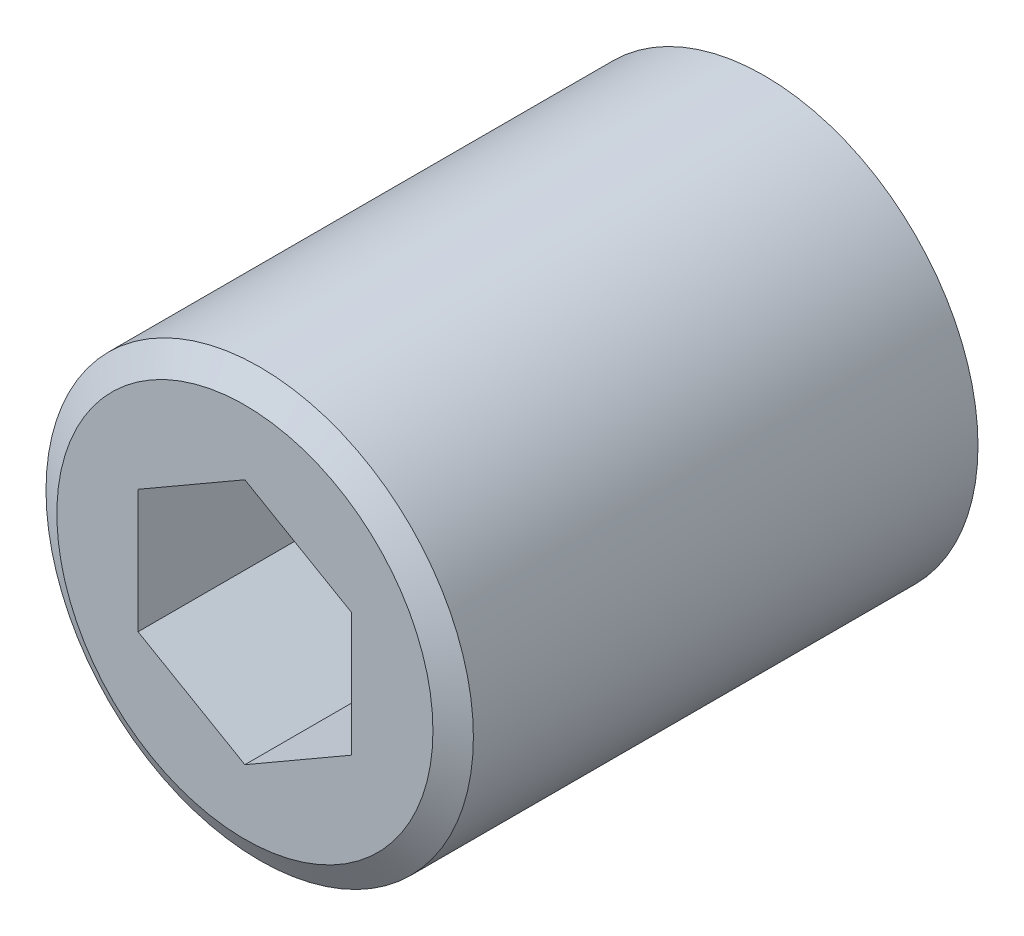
ISO-10303-21;
HEADER;
FILE_DESCRIPTION(('STEP AP214'),'2;1');
FILE_NAME('part.step','',(''),(''),'','','');
FILE_SCHEMA(('AUTOMOTIVE_DESIGN { 1 0 10303 214 1 1 1 1 }'));
ENDSEC;
DATA;
#1=APPLICATION_CONTEXT('core data for automotive mechanical design processes');
#2=APPLICATION_PROTOCOL_DEFINITION('international standard','automotive_design',2000,#1);
#3=PRODUCT_CONTEXT('',#1,'mechanical');
#4=PRODUCT('Part','Part','',(#3));
#5=PRODUCT_RELATED_PRODUCT_CATEGORY('part','',(#4));
#6=PRODUCT_DEFINITION_FORMATION('','',#4);
#7=PRODUCT_DEFINITION_CONTEXT('part definition',#1,'design');
#8=PRODUCT_DEFINITION('design','',#6,#7);
#9=PRODUCT_DEFINITION_SHAPE('','',#8);
#10=(LENGTH_UNIT() NAMED_UNIT(*) SI_UNIT(.MILLI.,.METRE.));
#11=(NAMED_UNIT(*) PLANE_ANGLE_UNIT() SI_UNIT($,.RADIAN.));
#12=(NAMED_UNIT(*) SI_UNIT($,.STERADIAN.) SOLID_ANGLE_UNIT());
#13=UNCERTAINTY_MEASURE_WITH_UNIT(LENGTH_MEASURE(1.E-05),#10,'distance_accuracy_value','');
#14=(GEOMETRIC_REPRESENTATION_CONTEXT(3) GLOBAL_UNCERTAINTY_ASSIGNED_CONTEXT((#13)) GLOBAL_UNIT_ASSIGNED_CONTEXT((#10,
#11,#12)) REPRESENTATION_CONTEXT('',''));
#15=CARTESIAN_POINT('',(0.,0.,0.));
#16=DIRECTION('',(0.,0.,1.));
#17=DIRECTION('',(1.,0.,0.));
#18=AXIS2_PLACEMENT_3D('',#15,#16,#17);
#19=CARTESIAN_POINT('',(10.,0.,1.27));
#20=DIRECTION('',(0.,0.,-1.));
#21=DIRECTION('',(-1.,0.,0.));
#22=AXIS2_PLACEMENT_3D('',#19,#20,#21);
#23=PLANE('',#22);
#24=CARTESIAN_POINT('',(0.,0.,1.27));
#25=DIRECTION('',(0.,0.,-1.));
#26=DIRECTION('',(-1.,0.,0.));
#27=AXIS2_PLACEMENT_3D('',#24,#25,#26);
#28=CIRCLE('',#27,8.8);
#29=CARTESIAN_POINT('',(-8.8,0.,1.27));
#30=VERTEX_POINT('',#29);
#31=EDGE_CURVE('E9',#30,#30,#28,.T.);
#32=ORIENTED_EDGE('',*,*,#31,.T.);
#33=EDGE_LOOP('',(#32));
#34=FACE_BOUND('',#33,.T.);
#35=CARTESIAN_POINT('',(0.,0.,1.27));
#36=DIRECTION('',(0.,0.,-1.));
#37=DIRECTION('',(-1.,0.,0.));
#38=AXIS2_PLACEMENT_3D('',#35,#36,#37);
#39=CIRCLE('',#38,6.35);
#40=CARTESIAN_POINT('',(-6.35,0.,1.27));
#41=VERTEX_POINT('',#40);
#42=EDGE_CURVE('E305',#41,#41,#39,.T.);
#43=ORIENTED_EDGE('',*,*,#42,.F.);
#44=EDGE_LOOP('',(#43));
#45=FACE_BOUND('',#44,.T.);
#46=ADVANCED_FACE('F15',(#34,#45),#23,.T.);
#47=CARTESIAN_POINT('',(0.,0.,46.27));
#48=DIRECTION('',(0.,0.,1.));
#49=DIRECTION('',(1.,0.,0.));
#50=AXIS2_PLACEMENT_3D('',#47,#48,#49);
#51=CYLINDRICAL_SURFACE('',#50,10.);
#52=CARTESIAN_POINT('',(0.,0.,25.5771796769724));
#53=DIRECTION('',(0.,0.,1.));
#54=DIRECTION('',(1.,0.,0.));
#55=AXIS2_PLACEMENT_3D('',#52,#53,#54);
#56=CIRCLE('',#55,10.);
#57=CARTESIAN_POINT('',(10.,0.,25.5771796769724));
#58=VERTEX_POINT('',#57);
#59=EDGE_CURVE('E24',#58,#58,#56,.F.);
#60=ORIENTED_EDGE('',*,*,#59,.T.);
#61=EDGE_LOOP('',(#60));
#62=FACE_BOUND('',#61,.T.);
#63=CARTESIAN_POINT('',(0.,0.,1.96282032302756));
#64=DIRECTION('',(0.,0.,-1.));
#65=DIRECTION('',(-1.,0.,0.));
#66=AXIS2_PLACEMENT_3D('',#63,#64,#65);
#67=CIRCLE('',#66,10.);
#68=CARTESIAN_POINT('',(-10.,0.,1.96282032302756));
#69=VERTEX_POINT('',#68);
#70=EDGE_CURVE('E240',#69,#69,#67,.F.);
#71=ORIENTED_EDGE('',*,*,#70,.T.);
#72=EDGE_LOOP('',(#71));
#73=FACE_BOUND('',#72,.T.);
#74=ADVANCED_FACE('F247',(#62,#73),#51,.T.);
#75=CARTESIAN_POINT('',(0.,0.,26.27));
#76=DIRECTION('',(0.,0.,1.));
#77=DIRECTION('',(1.,0.,0.));
#78=AXIS2_PLACEMENT_3D('',#75,#76,#77);
#79=PLANE('',#78);
#80=CARTESIAN_POINT('',(0.,0.,26.27));
#81=DIRECTION('',(0.,0.,1.));
#82=DIRECTION('',(1.,0.,0.));
#83=AXIS2_PLACEMENT_3D('',#80,#81,#82);
#84=CIRCLE('',#83,8.8);
#85=CARTESIAN_POINT('',(8.8,0.,26.27));
#86=VERTEX_POINT('',#85);
#87=EDGE_CURVE('E236',#86,#86,#84,.T.);
#88=ORIENTED_EDGE('',*,*,#87,.T.);
#89=EDGE_LOOP('',(#88));
#90=FACE_BOUND('',#89,.T.);
#91=DIRECTION('',(0.86602540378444,-0.5,0.));
#92=VECTOR('',#91,1.);
#93=CARTESIAN_POINT('',(-5.,-2.88675134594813,26.27));
#94=LINE('',#93,#92);
#95=CARTESIAN_POINT('',(-5.,-2.88675134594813,26.27));
#96=VERTEX_POINT('',#95);
#97=CARTESIAN_POINT('',(0.,-5.77350269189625,26.27));
#98=VERTEX_POINT('',#97);
#99=EDGE_CURVE('E153',#96,#98,#94,.T.);
#100=ORIENTED_EDGE('',*,*,#99,.F.);
#101=DIRECTION('',(0.,-1.,0.));
#102=VECTOR('',#101,1.);
#103=CARTESIAN_POINT('',(-5.,2.88675134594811,26.27));
#104=LINE('',#103,#102);
#105=CARTESIAN_POINT('',(-5.,2.88675134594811,26.27));
#106=VERTEX_POINT('',#105);
#107=EDGE_CURVE('E173',#106,#96,#104,.T.);
#108=ORIENTED_EDGE('',*,*,#107,.F.);
#109=DIRECTION('',(0.866025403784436,0.5,0.));
#110=VECTOR('',#109,1.);
#111=CARTESIAN_POINT('',(-5.,2.88675134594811,26.27));
#112=LINE('',#111,#110);
#113=CARTESIAN_POINT('',(0.,5.77350269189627,26.27));
#114=VERTEX_POINT('',#113);
#115=EDGE_CURVE('E169',#106,#114,#112,.T.);
#116=ORIENTED_EDGE('',*,*,#115,.T.);
#117=DIRECTION('',(-0.866025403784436,0.5,0.));
#118=VECTOR('',#117,1.);
#119=CARTESIAN_POINT('',(5.,2.88675134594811,26.27));
#120=LINE('',#119,#118);
#121=CARTESIAN_POINT('',(5.,2.88675134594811,26.27));
#122=VERTEX_POINT('',#121);
#123=EDGE_CURVE('E165',#122,#114,#120,.T.);
#124=ORIENTED_EDGE('',*,*,#123,.F.);
#125=DIRECTION('',(0.,-1.,0.));
#126=VECTOR('',#125,1.);
#127=CARTESIAN_POINT('',(5.,2.88675134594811,26.27));
#128=LINE('',#127,#126);
#129=CARTESIAN_POINT('',(5.,-2.88675134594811,26.27));
#130=VERTEX_POINT('',#129);
#131=EDGE_CURVE('E161',#122,#130,#128,.T.);
#132=ORIENTED_EDGE('',*,*,#131,.T.);
#133=DIRECTION('',(-0.866025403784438,-0.5,0.));
#134=VECTOR('',#133,1.);
#135=CARTESIAN_POINT('',(5.,-2.88675134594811,26.27));
#136=LINE('',#135,#134);
#137=EDGE_CURVE('E156',#130,#98,#136,.T.);
#138=ORIENTED_EDGE('',*,*,#137,.T.);
#139=EDGE_LOOP('',(#100,#108,#116,#124,#132,#138));
#140=FACE_BOUND('',#139,.T.);
#141=ADVANCED_FACE('F255',(#90,#140),#79,.T.);
#142=CARTESIAN_POINT('',(-5.,-2.88675134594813,18.27));
#143=DIRECTION('',(-0.5,-0.86602540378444,0.));
#144=DIRECTION('',(-0.86602540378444,0.5,0.));
#145=AXIS2_PLACEMENT_3D('',#142,#143,#144);
#146=PLANE('',#145);
#147=DIRECTION('',(0.,0.,1.));
#148=VECTOR('',#147,1.);
#149=CARTESIAN_POINT('',(-5.,-2.88675134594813,18.27));
#150=LINE('',#149,#148);
#151=CARTESIAN_POINT('',(-5.,-2.88675134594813,18.27));
#152=VERTEX_POINT('',#151);
#153=EDGE_CURVE('E217',#152,#96,#150,.T.);
#154=ORIENTED_EDGE('',*,*,#153,.T.);
#155=ORIENTED_EDGE('',*,*,#99,.T.);
#156=DIRECTION('',(0.,0.,1.));
#157=VECTOR('',#156,1.);
#158=CARTESIAN_POINT('',(0.,-5.77350269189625,18.27));
#159=LINE('',#158,#157);
#160=CARTESIAN_POINT('',(0.,-5.77350269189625,18.27));
#161=VERTEX_POINT('',#160);
#162=EDGE_CURVE('E201',#161,#98,#159,.T.);
#163=ORIENTED_EDGE('',*,*,#162,.F.);
#164=DIRECTION('',(0.86602540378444,-0.5,0.));
#165=VECTOR('',#164,1.);
#166=CARTESIAN_POINT('',(-5.,-2.88675134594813,18.27));
#167=LINE('',#166,#165);
#168=EDGE_CURVE('E177',#152,#161,#167,.T.);
#169=ORIENTED_EDGE('',*,*,#168,.F.);
#170=EDGE_LOOP('',(#154,#155,#163,#169));
#171=FACE_BOUND('',#170,.T.);
#172=ADVANCED_FACE('F258',(#171),#146,.F.);
#173=CARTESIAN_POINT('',(-5.,2.88675134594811,18.27));
#174=DIRECTION('',(-1.,0.,0.));
#175=DIRECTION('',(0.,1.,0.));
#176=AXIS2_PLACEMENT_3D('',#173,#174,#175);
#177=PLANE('',#176);
#178=DIRECTION('',(0.,0.,1.));
#179=VECTOR('',#178,1.);
#180=CARTESIAN_POINT('',(-5.,2.88675134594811,18.27));
#181=LINE('',#180,#179);
#182=CARTESIAN_POINT('',(-5.,2.88675134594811,18.27));
#183=VERTEX_POINT('',#182);
#184=EDGE_CURVE('E214',#183,#106,#181,.T.);
#185=ORIENTED_EDGE('',*,*,#184,.T.);
#186=ORIENTED_EDGE('',*,*,#107,.T.);
#187=ORIENTED_EDGE('',*,*,#153,.F.);
#188=DIRECTION('',(0.,-1.,0.));
#189=VECTOR('',#188,1.);
#190=CARTESIAN_POINT('',(-5.,2.88675134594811,18.27));
#191=LINE('',#190,#189);
#192=EDGE_CURVE('E197',#183,#152,#191,.T.);
#193=ORIENTED_EDGE('',*,*,#192,.F.);
#194=EDGE_LOOP('',(#185,#186,#187,#193));
#195=FACE_BOUND('',#194,.T.);
#196=ADVANCED_FACE('F284',(#195),#177,.F.);
#197=CARTESIAN_POINT('',(-5.,2.88675134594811,18.27));
#198=DIRECTION('',(0.5,-0.866025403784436,0.));
#199=DIRECTION('',(-0.866025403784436,-0.5,0.));
#200=AXIS2_PLACEMENT_3D('',#197,#198,#199);
#201=PLANE('',#200);
#202=DIRECTION('',(0.,0.,1.));
#203=VECTOR('',#202,1.);
#204=CARTESIAN_POINT('',(0.,5.77350269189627,18.27));
#205=LINE('',#204,#203);
#206=CARTESIAN_POINT('',(0.,5.77350269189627,18.27));
#207=VERTEX_POINT('',#206);
#208=EDGE_CURVE('E211',#207,#114,#205,.T.);
#209=ORIENTED_EDGE('',*,*,#208,.T.);
#210=ORIENTED_EDGE('',*,*,#115,.F.);
#211=ORIENTED_EDGE('',*,*,#184,.F.);
#212=DIRECTION('',(0.866025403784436,0.5,0.));
#213=VECTOR('',#212,1.);
#214=CARTESIAN_POINT('',(-5.,2.88675134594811,18.27));
#215=LINE('',#214,#213);
#216=EDGE_CURVE('E193',#183,#207,#215,.T.);
#217=ORIENTED_EDGE('',*,*,#216,.T.);
#218=EDGE_LOOP('',(#209,#210,#211,#217));
#219=FACE_BOUND('',#218,.T.);
#220=ADVANCED_FACE('F281',(#219),#201,.T.);
#221=CARTESIAN_POINT('',(5.,2.88675134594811,18.27));
#222=DIRECTION('',(0.5,0.866025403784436,0.));
#223=DIRECTION('',(0.866025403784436,-0.5,0.));
#224=AXIS2_PLACEMENT_3D('',#221,#222,#223);
#225=PLANE('',#224);
#226=DIRECTION('',(0.,0.,1.));
#227=VECTOR('',#226,1.);
#228=CARTESIAN_POINT('',(5.,2.88675134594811,18.27));
#229=LINE('',#228,#227);
#230=CARTESIAN_POINT('',(5.,2.88675134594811,18.27));
#231=VERTEX_POINT('',#230);
#232=EDGE_CURVE('E208',#231,#122,#229,.T.);
#233=ORIENTED_EDGE('',*,*,#232,.T.);
#234=ORIENTED_EDGE('',*,*,#123,.T.);
#235=ORIENTED_EDGE('',*,*,#208,.F.);
#236=DIRECTION('',(-0.866025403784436,0.5,0.));
#237=VECTOR('',#236,1.);
#238=CARTESIAN_POINT('',(5.,2.88675134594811,18.27));
#239=LINE('',#238,#237);
#240=EDGE_CURVE('E189',#231,#207,#239,.T.);
#241=ORIENTED_EDGE('',*,*,#240,.F.);
#242=EDGE_LOOP('',(#233,#234,#235,#241));
#243=FACE_BOUND('',#242,.T.);
#244=ADVANCED_FACE('F277',(#243),#225,.F.);
#245=CARTESIAN_POINT('',(5.,2.88675134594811,18.27));
#246=DIRECTION('',(-1.,0.,0.));
#247=DIRECTION('',(0.,1.,0.));
#248=AXIS2_PLACEMENT_3D('',#245,#246,#247);
#249=PLANE('',#248);
#250=DIRECTION('',(0.,0.,1.));
#251=VECTOR('',#250,1.);
#252=CARTESIAN_POINT('',(5.,-2.88675134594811,18.27));
#253=LINE('',#252,#251);
#254=CARTESIAN_POINT('',(5.,-2.88675134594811,18.27));
#255=VERTEX_POINT('',#254);
#256=EDGE_CURVE('E205',#255,#130,#253,.T.);
#257=ORIENTED_EDGE('',*,*,#256,.T.);
#258=ORIENTED_EDGE('',*,*,#131,.F.);
#259=ORIENTED_EDGE('',*,*,#232,.F.);
#260=DIRECTION('',(0.,-1.,0.));
#261=VECTOR('',#260,1.);
#262=CARTESIAN_POINT('',(5.,2.88675134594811,18.27));
#263=LINE('',#262,#261);
#264=EDGE_CURVE('E185',#231,#255,#263,.T.);
#265=ORIENTED_EDGE('',*,*,#264,.T.);
#266=EDGE_LOOP('',(#257,#258,#259,#265));
#267=FACE_BOUND('',#266,.T.);
#268=ADVANCED_FACE('F273',(#267),#249,.T.);
#269=CARTESIAN_POINT('',(5.,-2.88675134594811,18.27));
#270=DIRECTION('',(-0.5,0.866025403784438,0.));
#271=DIRECTION('',(0.866025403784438,0.5,0.));
#272=AXIS2_PLACEMENT_3D('',#269,#270,#271);
#273=PLANE('',#272);
#274=DIRECTION('',(-0.866025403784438,-0.5,0.));
#275=VECTOR('',#274,1.);
#276=CARTESIAN_POINT('',(5.,-2.88675134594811,18.27));
#277=LINE('',#276,#275);
#278=EDGE_CURVE('E181',#255,#161,#277,.T.);
#279=ORIENTED_EDGE('',*,*,#278,.T.);
#280=ORIENTED_EDGE('',*,*,#162,.T.);
#281=ORIENTED_EDGE('',*,*,#137,.F.);
#282=ORIENTED_EDGE('',*,*,#256,.F.);
#283=EDGE_LOOP('',(#279,#280,#281,#282));
#284=FACE_BOUND('',#283,.T.);
#285=ADVANCED_FACE('F266',(#284),#273,.T.);
#286=CARTESIAN_POINT('',(5.,-8.66025403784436,18.27));
#287=DIRECTION('',(0.,0.,-1.));
#288=DIRECTION('',(-1.,0.,0.));
#289=AXIS2_PLACEMENT_3D('',#286,#287,#288);
#290=PLANE('',#289);
#291=ORIENTED_EDGE('',*,*,#168,.T.);
#292=ORIENTED_EDGE('',*,*,#278,.F.);
#293=ORIENTED_EDGE('',*,*,#264,.F.);
#294=ORIENTED_EDGE('',*,*,#240,.T.);
#295=ORIENTED_EDGE('',*,*,#216,.F.);
#296=ORIENTED_EDGE('',*,*,#192,.T.);
#297=EDGE_LOOP('',(#291,#292,#293,#294,#295,#296));
#298=FACE_BOUND('',#297,.T.);
#299=ADVANCED_FACE('F270',(#298),#290,.F.);
#300=CARTESIAN_POINT('',(0.,0.,13.97));
#301=DIRECTION('',(0.,0.,-1.));
#302=DIRECTION('',(-1.,0.,0.));
#303=AXIS2_PLACEMENT_3D('',#300,#301,#302);
#304=CYLINDRICAL_SURFACE('',#303,6.35);
#305=ORIENTED_EDGE('',*,*,#42,.T.);
#306=EDGE_LOOP('',(#305));
#307=FACE_BOUND('',#306,.T.);
#308=CARTESIAN_POINT('',(0.,0.,1.5));
#309=DIRECTION('',(0.,0.,1.));
#310=DIRECTION('',(1.,0.,0.));
#311=AXIS2_PLACEMENT_3D('',#308,#309,#310);
#312=CIRCLE('',#311,6.35);
#313=CARTESIAN_POINT('',(6.35,0.,1.5));
#314=VERTEX_POINT('',#313);
#315=EDGE_CURVE('E134',#314,#314,#312,.T.);
#316=ORIENTED_EDGE('',*,*,#315,.T.);
#317=EDGE_LOOP('',(#316));
#318=FACE_BOUND('',#317,.T.);
#319=ADVANCED_FACE('F417',(#307,#318),#304,.F.);
#320=CARTESIAN_POINT('',(6.35,0.,1.5));
#321=DIRECTION('',(0.,-0.707106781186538,0.707106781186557));
#322=DIRECTION('',(0.,0.707106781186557,0.707106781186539));
#323=AXIS2_PLACEMENT_3D('',#320,#321,#322);
#324=PLANE('',#323);
#325=DIRECTION('',(-1.,0.,0.));
#326=VECTOR('',#325,1.);
#327=CARTESIAN_POINT('',(6.35,0.,1.5));
#328=LINE('',#327,#326);
#329=CARTESIAN_POINT('',(0.,0.,1.5));
#330=VERTEX_POINT('',#329);
#331=CARTESIAN_POINT('',(-3.,0.,1.5));
#332=VERTEX_POINT('',#331);
#333=EDGE_CURVE('E313',#330,#332,#328,.T.);
#334=ORIENTED_EDGE('',*,*,#333,.F.);
#335=DIRECTION('',(0.577350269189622,0.577350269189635,0.57735026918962));
#336=VECTOR('',#335,1.);
#337=CARTESIAN_POINT('',(-2.11666666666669,-2.11666666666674,-0.616666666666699));
#338=LINE('',#337,#336);
#339=CARTESIAN_POINT('',(-1.5,-1.5,0.));
#340=VERTEX_POINT('',#339);
#341=EDGE_CURVE('E341',#340,#330,#338,.T.);
#342=ORIENTED_EDGE('',*,*,#341,.F.);
#343=DIRECTION('',(0.577350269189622,-0.577350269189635,-0.57735026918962));
#344=VECTOR('',#343,1.);
#345=CARTESIAN_POINT('',(0.116666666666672,-3.11666666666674,-1.61666666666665));
#346=LINE('',#345,#344);
#347=EDGE_CURVE('E345',#332,#340,#346,.T.);
#348=ORIENTED_EDGE('',*,*,#347,.F.);
#349=EDGE_LOOP('',(#334,#342,#348));
#350=FACE_BOUND('',#349,.T.);
#351=ADVANCED_FACE('F383',(#350),#324,.F.);
#352=CARTESIAN_POINT('',(6.35,1.49999999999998,0.));
#353=DIRECTION('',(0.,0.707106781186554,0.707106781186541));
#354=DIRECTION('',(0.,0.707106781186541,-0.707106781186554));
#355=AXIS2_PLACEMENT_3D('',#352,#353,#354);
#356=PLANE('',#355);
#357=DIRECTION('',(-0.577350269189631,0.577350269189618,-0.577350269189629));
#358=VECTOR('',#357,1.);
#359=CARTESIAN_POINT('',(2.11666666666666,-2.11666666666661,3.61666666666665));
#360=LINE('',#359,#358);
#361=CARTESIAN_POINT('',(-1.49999999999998,1.49999999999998,0.));
#362=VERTEX_POINT('',#361);
#363=EDGE_CURVE('E352',#330,#362,#360,.T.);
#364=ORIENTED_EDGE('',*,*,#363,.F.);
#365=ORIENTED_EDGE('',*,*,#333,.T.);
#366=DIRECTION('',(-0.577350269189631,-0.577350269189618,0.577350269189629));
#367=VECTOR('',#366,1.);
#368=CARTESIAN_POINT('',(-4.11666666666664,-1.11666666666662,2.61666666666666));
#369=LINE('',#368,#367);
#370=EDGE_CURVE('E137',#362,#332,#369,.T.);
#371=ORIENTED_EDGE('',*,*,#370,.F.);
#372=EDGE_LOOP('',(#364,#365,#371));
#373=FACE_BOUND('',#372,.T.);
#374=ADVANCED_FACE('F381',(#373),#356,.F.);
#375=CARTESIAN_POINT('',(0.,-6.35,1.5));
#376=DIRECTION('',(-0.707106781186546,0.,0.707106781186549));
#377=DIRECTION('',(0.707106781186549,0.,0.707106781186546));
#378=AXIS2_PLACEMENT_3D('',#375,#376,#377);
#379=PLANE('',#378);
#380=DIRECTION('',(0.,1.,0.));
#381=VECTOR('',#380,1.);
#382=CARTESIAN_POINT('',(0.,-6.35,1.5));
#383=LINE('',#382,#381);
#384=CARTESIAN_POINT('',(0.,3.00000000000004,1.5));
#385=VERTEX_POINT('',#384);
#386=EDGE_CURVE('E145',#330,#385,#383,.T.);
#387=ORIENTED_EDGE('',*,*,#386,.F.);
#388=ORIENTED_EDGE('',*,*,#363,.T.);
#389=DIRECTION('',(0.577350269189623,0.577350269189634,0.577350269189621));
#390=VECTOR('',#389,1.);
#391=CARTESIAN_POINT('',(-3.1166666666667,-0.116666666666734,-1.6166666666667));
#392=LINE('',#391,#390);
#393=EDGE_CURVE('E115',#362,#385,#392,.T.);
#394=ORIENTED_EDGE('',*,*,#393,.T.);
#395=EDGE_LOOP('',(#387,#388,#394));
#396=FACE_BOUND('',#395,.T.);
#397=ADVANCED_FACE('F377',(#396),#379,.F.);
#398=CARTESIAN_POINT('',(1.5,-6.35,0.));
#399=DIRECTION('',(0.707106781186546,0.,0.707106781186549));
#400=DIRECTION('',(0.707106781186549,0.,-0.707106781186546));
#401=AXIS2_PLACEMENT_3D('',#398,#399,#400);
#402=PLANE('',#401);
#403=DIRECTION('',(0.577350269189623,-0.577350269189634,-0.577350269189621));
#404=VECTOR('',#403,1.);
#405=CARTESIAN_POINT('',(4.11666666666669,-1.11666666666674,-2.6166666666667));
#406=LINE('',#405,#404);
#407=CARTESIAN_POINT('',(1.49999999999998,1.49999999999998,0.));
#408=VERTEX_POINT('',#407);
#409=EDGE_CURVE('E321',#385,#408,#406,.T.);
#410=ORIENTED_EDGE('',*,*,#409,.T.);
#411=DIRECTION('',(-0.577350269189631,-0.577350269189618,0.577350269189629));
#412=VECTOR('',#411,1.);
#413=CARTESIAN_POINT('',(-1.11666666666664,-1.11666666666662,2.61666666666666));
#414=LINE('',#413,#412);
#415=EDGE_CURVE('E348',#408,#330,#414,.T.);
#416=ORIENTED_EDGE('',*,*,#415,.T.);
#417=ORIENTED_EDGE('',*,*,#386,.T.);
#418=EDGE_LOOP('',(#410,#416,#417));
#419=FACE_BOUND('',#418,.T.);
#420=ADVANCED_FACE('F375',(#419),#402,.F.);
#421=DIRECTION('',(-0.577350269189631,0.577350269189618,-0.577350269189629));
#422=VECTOR('',#421,1.);
#423=CARTESIAN_POINT('',(4.11666666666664,-1.11666666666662,2.61666666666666));
#424=LINE('',#423,#422);
#425=CARTESIAN_POINT('',(3.,0.,1.5));
#426=VERTEX_POINT('',#425);
#427=EDGE_CURVE('E224',#426,#408,#424,.T.);
#428=ORIENTED_EDGE('',*,*,#427,.F.);
#429=EDGE_CURVE('E31',#426,#330,#328,.T.);
#430=ORIENTED_EDGE('',*,*,#429,.T.);
#431=ORIENTED_EDGE('',*,*,#415,.F.);
#432=EDGE_LOOP('',(#428,#430,#431));
#433=FACE_BOUND('',#432,.T.);
#434=ADVANCED_FACE('F405',(#433),#356,.F.);
#435=ORIENTED_EDGE('',*,*,#429,.F.);
#436=DIRECTION('',(0.577350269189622,0.577350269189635,0.57735026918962));
#437=VECTOR('',#436,1.);
#438=CARTESIAN_POINT('',(-0.116666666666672,-3.11666666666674,-1.61666666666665));
#439=LINE('',#438,#437);
#440=CARTESIAN_POINT('',(1.5,-1.5,0.));
#441=VERTEX_POINT('',#440);
#442=EDGE_CURVE('E228',#441,#426,#439,.T.);
#443=ORIENTED_EDGE('',*,*,#442,.F.);
#444=DIRECTION('',(0.577350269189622,-0.577350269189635,-0.57735026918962));
#445=VECTOR('',#444,1.);
#446=CARTESIAN_POINT('',(3.11666666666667,-3.11666666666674,-1.61666666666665));
#447=LINE('',#446,#445);
#448=EDGE_CURVE('E337',#330,#441,#447,.T.);
#449=ORIENTED_EDGE('',*,*,#448,.F.);
#450=EDGE_LOOP('',(#435,#443,#449));
#451=FACE_BOUND('',#450,.T.);
#452=ADVANCED_FACE('F452',(#451),#324,.F.);
#453=ORIENTED_EDGE('',*,*,#448,.T.);
#454=DIRECTION('',(-0.57735026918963,-0.577350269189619,0.577350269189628));
#455=VECTOR('',#454,1.);
#456=CARTESIAN_POINT('',(-0.116666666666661,-3.11666666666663,1.61666666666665));
#457=LINE('',#456,#455);
#458=CARTESIAN_POINT('',(0.,-3.,1.5));
#459=VERTEX_POINT('',#458);
#460=EDGE_CURVE('E39',#441,#459,#457,.T.);
#461=ORIENTED_EDGE('',*,*,#460,.T.);
#462=EDGE_CURVE('E157',#459,#330,#383,.T.);
#463=ORIENTED_EDGE('',*,*,#462,.T.);
#464=EDGE_LOOP('',(#453,#461,#463));
#465=FACE_BOUND('',#464,.T.);
#466=ADVANCED_FACE('F366',(#465),#402,.F.);
#467=ORIENTED_EDGE('',*,*,#462,.F.);
#468=DIRECTION('',(-0.57735026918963,0.577350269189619,-0.577350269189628));
#469=VECTOR('',#468,1.);
#470=CARTESIAN_POINT('',(1.11666666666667,-4.11666666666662,2.61666666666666));
#471=LINE('',#470,#469);
#472=EDGE_CURVE('E329',#459,#340,#471,.T.);
#473=ORIENTED_EDGE('',*,*,#472,.T.);
#474=ORIENTED_EDGE('',*,*,#341,.T.);
#475=EDGE_LOOP('',(#467,#473,#474));
#476=FACE_BOUND('',#475,.T.);
#477=ADVANCED_FACE('F368',(#476),#379,.F.);
#478=CARTESIAN_POINT('',(-1.5,-6.35,0.));
#479=DIRECTION('',(0.707106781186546,0.,0.707106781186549));
#480=DIRECTION('',(0.707106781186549,0.,-0.707106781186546));
#481=AXIS2_PLACEMENT_3D('',#478,#479,#480);
#482=PLANE('',#481);
#483=ORIENTED_EDGE('',*,*,#347,.T.);
#484=DIRECTION('',(-0.577350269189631,-0.577350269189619,0.577350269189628));
#485=VECTOR('',#484,1.);
#486=CARTESIAN_POINT('',(-3.11666666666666,-3.11666666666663,1.61666666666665));
#487=LINE('',#486,#485);
#488=CARTESIAN_POINT('',(-3.,-3.,1.5));
#489=VERTEX_POINT('',#488);
#490=EDGE_CURVE('E333',#340,#489,#487,.T.);
#491=ORIENTED_EDGE('',*,*,#490,.T.);
#492=DIRECTION('',(0.,1.,0.));
#493=VECTOR('',#492,1.);
#494=CARTESIAN_POINT('',(-3.,-6.35,1.5));
#495=LINE('',#494,#493);
#496=EDGE_CURVE('E139',#489,#332,#495,.T.);
#497=ORIENTED_EDGE('',*,*,#496,.T.);
#498=EDGE_LOOP('',(#483,#491,#497));
#499=FACE_BOUND('',#498,.T.);
#500=ADVANCED_FACE('F386',(#499),#482,.F.);
#501=DIRECTION('',(0.577350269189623,-0.577350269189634,-0.577350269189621));
#502=VECTOR('',#501,1.);
#503=CARTESIAN_POINT('',(1.11666666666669,-1.11666666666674,-2.6166666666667));
#504=LINE('',#503,#502);
#505=CARTESIAN_POINT('',(-3.,3.,1.5));
#506=VERTEX_POINT('',#505);
#507=EDGE_CURVE('E109',#506,#362,#504,.T.);
#508=ORIENTED_EDGE('',*,*,#507,.T.);
#509=ORIENTED_EDGE('',*,*,#370,.T.);
#510=EDGE_CURVE('E129',#332,#506,#495,.T.);
#511=ORIENTED_EDGE('',*,*,#510,.T.);
#512=EDGE_LOOP('',(#508,#509,#511));
#513=FACE_BOUND('',#512,.T.);
#514=ADVANCED_FACE('F136',(#513),#482,.F.);
#515=CARTESIAN_POINT('',(6.35,1.49999999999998,0.));
#516=DIRECTION('',(0.,-0.707106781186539,0.707106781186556));
#517=DIRECTION('',(0.,0.707106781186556,0.707106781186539));
#518=AXIS2_PLACEMENT_3D('',#515,#516,#517);
#519=PLANE('',#518);
#520=DIRECTION('',(-1.,0.,0.));
#521=VECTOR('',#520,1.);
#522=CARTESIAN_POINT('',(6.35,3.,1.5));
#523=LINE('',#522,#521);
#524=EDGE_CURVE('E112',#385,#506,#523,.T.);
#525=ORIENTED_EDGE('',*,*,#524,.F.);
#526=ORIENTED_EDGE('',*,*,#393,.F.);
#527=ORIENTED_EDGE('',*,*,#507,.F.);
#528=EDGE_LOOP('',(#525,#526,#527));
#529=FACE_BOUND('',#528,.T.);
#530=ADVANCED_FACE('F111',(#529),#519,.F.);
#531=CARTESIAN_POINT('',(3.,3.,1.5));
#532=VERTEX_POINT('',#531);
#533=EDGE_CURVE('E132',#532,#385,#523,.T.);
#534=ORIENTED_EDGE('',*,*,#533,.F.);
#535=DIRECTION('',(0.577350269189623,0.577350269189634,0.577350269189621));
#536=VECTOR('',#535,1.);
#537=CARTESIAN_POINT('',(-1.11666666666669,-1.11666666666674,-2.6166666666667));
#538=LINE('',#537,#536);
#539=EDGE_CURVE('E220',#408,#532,#538,.T.);
#540=ORIENTED_EDGE('',*,*,#539,.F.);
#541=ORIENTED_EDGE('',*,*,#409,.F.);
#542=EDGE_LOOP('',(#534,#540,#541));
#543=FACE_BOUND('',#542,.T.);
#544=ADVANCED_FACE('F402',(#543),#519,.F.);
#545=CARTESIAN_POINT('',(1.5,-6.35,0.));
#546=DIRECTION('',(-0.707106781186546,0.,0.707106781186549));
#547=DIRECTION('',(0.707106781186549,0.,0.707106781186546));
#548=AXIS2_PLACEMENT_3D('',#545,#546,#547);
#549=PLANE('',#548);
#550=DIRECTION('',(0.,1.,0.));
#551=VECTOR('',#550,1.);
#552=CARTESIAN_POINT('',(3.,-6.35,1.5));
#553=LINE('',#552,#551);
#554=EDGE_CURVE('E147',#426,#532,#553,.T.);
#555=ORIENTED_EDGE('',*,*,#554,.F.);
#556=ORIENTED_EDGE('',*,*,#427,.T.);
#557=ORIENTED_EDGE('',*,*,#539,.T.);
#558=EDGE_LOOP('',(#555,#556,#557));
#559=FACE_BOUND('',#558,.T.);
#560=ADVANCED_FACE('F410',(#559),#549,.F.);
#561=CARTESIAN_POINT('',(3.00000000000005,-3.,1.5));
#562=VERTEX_POINT('',#561);
#563=EDGE_CURVE('E140',#562,#426,#553,.T.);
#564=ORIENTED_EDGE('',*,*,#563,.F.);
#565=DIRECTION('',(-0.57735026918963,0.577350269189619,-0.577350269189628));
#566=VECTOR('',#565,1.);
#567=CARTESIAN_POINT('',(3.11666666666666,-3.11666666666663,1.61666666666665));
#568=LINE('',#567,#566);
#569=EDGE_CURVE('E232',#562,#441,#568,.T.);
#570=ORIENTED_EDGE('',*,*,#569,.T.);
#571=ORIENTED_EDGE('',*,*,#442,.T.);
#572=EDGE_LOOP('',(#564,#570,#571));
#573=FACE_BOUND('',#572,.T.);
#574=ADVANCED_FACE('F396',(#573),#549,.F.);
#575=CARTESIAN_POINT('',(6.35,-1.5,0.));
#576=DIRECTION('',(0.,0.707106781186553,0.707106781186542));
#577=DIRECTION('',(0.,0.707106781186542,-0.707106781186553));
#578=AXIS2_PLACEMENT_3D('',#575,#576,#577);
#579=PLANE('',#578);
#580=ORIENTED_EDGE('',*,*,#569,.F.);
#581=DIRECTION('',(-1.,0.,0.));
#582=VECTOR('',#581,1.);
#583=CARTESIAN_POINT('',(6.35,-3.,1.5));
#584=LINE('',#583,#582);
#585=EDGE_CURVE('E317',#562,#459,#584,.T.);
#586=ORIENTED_EDGE('',*,*,#585,.T.);
#587=ORIENTED_EDGE('',*,*,#460,.F.);
#588=EDGE_LOOP('',(#580,#586,#587));
#589=FACE_BOUND('',#588,.T.);
#590=ADVANCED_FACE('F361',(#589),#579,.F.);
#591=ORIENTED_EDGE('',*,*,#472,.F.);
#592=EDGE_CURVE('E318',#459,#489,#584,.T.);
#593=ORIENTED_EDGE('',*,*,#592,.T.);
#594=ORIENTED_EDGE('',*,*,#490,.F.);
#595=EDGE_LOOP('',(#591,#593,#594));
#596=FACE_BOUND('',#595,.T.);
#597=ADVANCED_FACE('F388',(#596),#579,.F.);
#598=CARTESIAN_POINT('',(-3.,-6.35,1.5));
#599=DIRECTION('',(0.,0.,1.));
#600=DIRECTION('',(1.,0.,0.));
#601=AXIS2_PLACEMENT_3D('',#598,#599,#600);
#602=PLANE('',#601);
#603=ORIENTED_EDGE('',*,*,#592,.F.);
#604=ORIENTED_EDGE('',*,*,#585,.F.);
#605=ORIENTED_EDGE('',*,*,#563,.T.);
#606=ORIENTED_EDGE('',*,*,#554,.T.);
#607=ORIENTED_EDGE('',*,*,#533,.T.);
#608=ORIENTED_EDGE('',*,*,#524,.T.);
#609=ORIENTED_EDGE('',*,*,#510,.F.);
#610=ORIENTED_EDGE('',*,*,#496,.F.);
#611=EDGE_LOOP('',(#603,#604,#605,#606,#607,#608,#609,#610));
#612=FACE_BOUND('',#611,.T.);
#613=ORIENTED_EDGE('',*,*,#315,.F.);
#614=EDGE_LOOP('',(#613));
#615=FACE_BOUND('',#614,.T.);
#616=ADVANCED_FACE('F126',(#612,#615),#602,.F.);
#617=CARTESIAN_POINT('',(0.,0.,26.27));
#618=DIRECTION('',(0.,0.,-1.));
#619=DIRECTION('',(-1.,0.,0.));
#620=AXIS2_PLACEMENT_3D('',#617,#618,#619);
#621=CONICAL_SURFACE('',#620,8.8,1.0471975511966);
#622=ORIENTED_EDGE('',*,*,#59,.F.);
#623=EDGE_LOOP('',(#622));
#624=FACE_BOUND('',#623,.T.);
#625=ORIENTED_EDGE('',*,*,#87,.F.);
#626=EDGE_LOOP('',(#625));
#627=FACE_BOUND('',#626,.T.);
#628=ADVANCED_FACE('F250',(#624,#627),#621,.T.);
#629=CARTESIAN_POINT('',(0.,0.,1.96282032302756));
#630=DIRECTION('',(0.,0.,1.));
#631=DIRECTION('',(1.,0.,0.));
#632=AXIS2_PLACEMENT_3D('',#629,#630,#631);
#633=CONICAL_SURFACE('',#632,10.,1.0471975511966);
#634=ORIENTED_EDGE('',*,*,#31,.F.);
#635=EDGE_LOOP('',(#634));
#636=FACE_BOUND('',#635,.T.);
#637=ORIENTED_EDGE('',*,*,#70,.F.);
#638=EDGE_LOOP('',(#637));
#639=FACE_BOUND('',#638,.T.);
#640=ADVANCED_FACE('F17',(#636,#639),#633,.T.);
#641=CLOSED_SHELL('',(#46,#74,#141,#172,#196,#220,#244,#268,#285,#299,#319,#351,#374,#397,#420,
#434,#452,#466,#477,#500,#514,#530,#544,#560,#574,#590,#597,#616,#628,#640));
#642=MANIFOLD_SOLID_BREP('B1',#641);
#643=ADVANCED_BREP_SHAPE_REPRESENTATION('',(#18,#642),#14);
#644=SHAPE_DEFINITION_REPRESENTATION(#9,#643);
ENDSEC;
END-ISO-10303-21;
